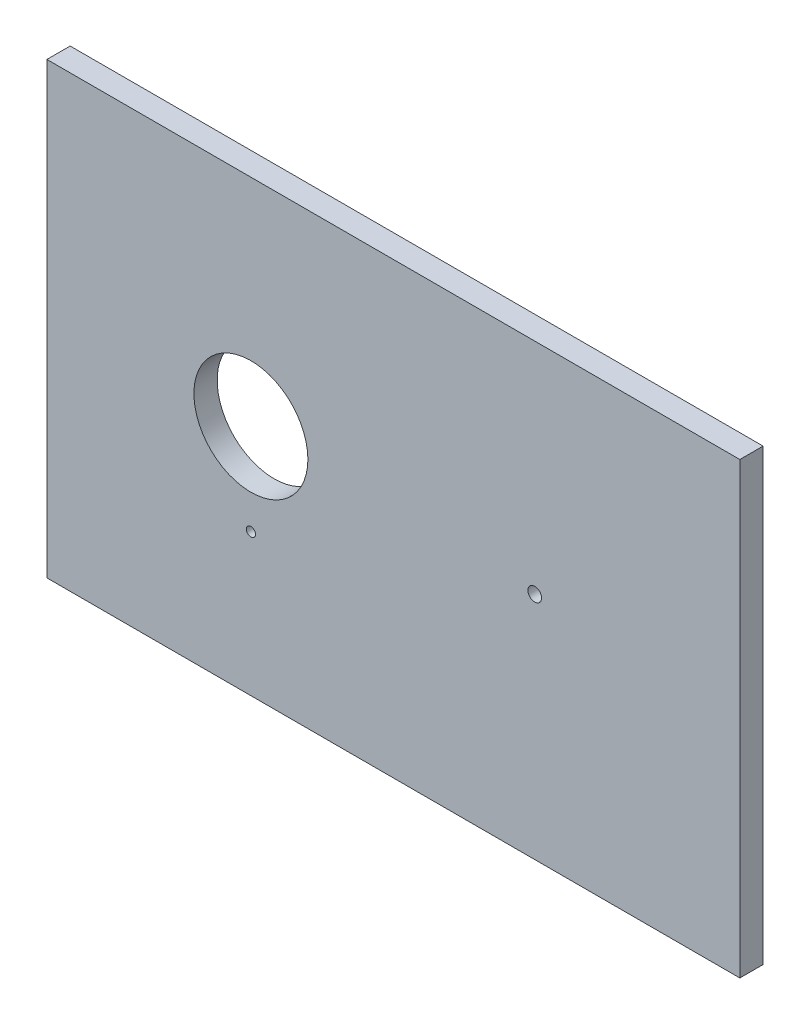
ISO-10303-21;
HEADER;
FILE_DESCRIPTION(('STEP AP214'),'2;1');
FILE_NAME('part.step','',(''),(''),'','','');
FILE_SCHEMA(('AUTOMOTIVE_DESIGN { 1 0 10303 214 1 1 1 1 }'));
ENDSEC;
DATA;
#1=APPLICATION_CONTEXT('core data for automotive mechanical design processes');
#2=APPLICATION_PROTOCOL_DEFINITION('international standard','automotive_design',2000,#1);
#3=PRODUCT_CONTEXT('',#1,'mechanical');
#4=PRODUCT('Part','Part','',(#3));
#5=PRODUCT_RELATED_PRODUCT_CATEGORY('part','',(#4));
#6=PRODUCT_DEFINITION_FORMATION('','',#4);
#7=PRODUCT_DEFINITION_CONTEXT('part definition',#1,'design');
#8=PRODUCT_DEFINITION('design','',#6,#7);
#9=PRODUCT_DEFINITION_SHAPE('','',#8);
#10=(LENGTH_UNIT() NAMED_UNIT(*) SI_UNIT(.MILLI.,.METRE.));
#11=(NAMED_UNIT(*) PLANE_ANGLE_UNIT() SI_UNIT($,.RADIAN.));
#12=(NAMED_UNIT(*) SI_UNIT($,.STERADIAN.) SOLID_ANGLE_UNIT());
#13=UNCERTAINTY_MEASURE_WITH_UNIT(LENGTH_MEASURE(1.E-05),#10,'distance_accuracy_value','');
#14=(GEOMETRIC_REPRESENTATION_CONTEXT(3) GLOBAL_UNCERTAINTY_ASSIGNED_CONTEXT((#13)) GLOBAL_UNIT_ASSIGNED_CONTEXT((#10,
#11,#12)) REPRESENTATION_CONTEXT('',''));
#15=CARTESIAN_POINT('',(0.,0.,0.));
#16=DIRECTION('',(0.,0.,1.));
#17=DIRECTION('',(1.,0.,0.));
#18=AXIS2_PLACEMENT_3D('',#15,#16,#17);
#19=CARTESIAN_POINT('',(152.,98.5,5.1));
#20=DIRECTION('',(-1.,0.,0.));
#21=DIRECTION('',(0.,-1.,0.));
#22=AXIS2_PLACEMENT_3D('',#19,#20,#21);
#23=PLANE('',#22);
#24=DIRECTION('',(0.,1.,0.));
#25=VECTOR('',#24,1.);
#26=CARTESIAN_POINT('',(152.,98.5,-5.1));
#27=LINE('',#26,#25);
#28=CARTESIAN_POINT('',(152.,-98.5,-5.1));
#29=VERTEX_POINT('',#28);
#30=CARTESIAN_POINT('',(152.,98.5,-5.1));
#31=VERTEX_POINT('',#30);
#32=EDGE_CURVE('E98',#29,#31,#27,.T.);
#33=ORIENTED_EDGE('',*,*,#32,.T.);
#34=DIRECTION('',(0.,0.,-1.));
#35=VECTOR('',#34,1.);
#36=CARTESIAN_POINT('',(152.,98.5,5.1));
#37=LINE('',#36,#35);
#38=CARTESIAN_POINT('',(152.,98.5,5.1));
#39=VERTEX_POINT('',#38);
#40=EDGE_CURVE('E11',#39,#31,#37,.T.);
#41=ORIENTED_EDGE('',*,*,#40,.F.);
#42=DIRECTION('',(0.,1.,0.));
#43=VECTOR('',#42,1.);
#44=CARTESIAN_POINT('',(152.,98.5,5.1));
#45=LINE('',#44,#43);
#46=CARTESIAN_POINT('',(152.,-98.5,5.1));
#47=VERTEX_POINT('',#46);
#48=EDGE_CURVE('E85',#47,#39,#45,.T.);
#49=ORIENTED_EDGE('',*,*,#48,.F.);
#50=DIRECTION('',(0.,0.,-1.));
#51=VECTOR('',#50,1.);
#52=CARTESIAN_POINT('',(152.,-98.5,5.1));
#53=LINE('',#52,#51);
#54=EDGE_CURVE('E94',#47,#29,#53,.T.);
#55=ORIENTED_EDGE('',*,*,#54,.T.);
#56=EDGE_LOOP('',(#33,#41,#49,#55));
#57=FACE_BOUND('',#56,.T.);
#58=ADVANCED_FACE('F32',(#57),#23,.F.);
#59=CARTESIAN_POINT('',(-152.,98.5,5.1));
#60=DIRECTION('',(0.,-1.,0.));
#61=DIRECTION('',(0.,0.,-1.));
#62=AXIS2_PLACEMENT_3D('',#59,#60,#61);
#63=PLANE('',#62);
#64=DIRECTION('',(-1.,0.,0.));
#65=VECTOR('',#64,1.);
#66=CARTESIAN_POINT('',(-152.,98.5,-5.1));
#67=LINE('',#66,#65);
#68=CARTESIAN_POINT('',(-152.,98.5,-5.1));
#69=VERTEX_POINT('',#68);
#70=EDGE_CURVE('E89',#31,#69,#67,.T.);
#71=ORIENTED_EDGE('',*,*,#70,.T.);
#72=DIRECTION('',(0.,0.,-1.));
#73=VECTOR('',#72,1.);
#74=CARTESIAN_POINT('',(-152.,98.5,5.1));
#75=LINE('',#74,#73);
#76=CARTESIAN_POINT('',(-152.,98.5,5.1));
#77=VERTEX_POINT('',#76);
#78=EDGE_CURVE('E41',#77,#69,#75,.T.);
#79=ORIENTED_EDGE('',*,*,#78,.F.);
#80=DIRECTION('',(-1.,0.,0.));
#81=VECTOR('',#80,1.);
#82=CARTESIAN_POINT('',(-152.,98.5,5.1));
#83=LINE('',#82,#81);
#84=EDGE_CURVE('E80',#39,#77,#83,.T.);
#85=ORIENTED_EDGE('',*,*,#84,.F.);
#86=ORIENTED_EDGE('',*,*,#40,.T.);
#87=EDGE_LOOP('',(#71,#79,#85,#86));
#88=FACE_BOUND('',#87,.T.);
#89=ADVANCED_FACE('F88',(#88),#63,.F.);
#90=CARTESIAN_POINT('',(-152.,98.5,5.1));
#91=DIRECTION('',(1.,0.,0.));
#92=DIRECTION('',(0.,0.,-1.));
#93=AXIS2_PLACEMENT_3D('',#90,#91,#92);
#94=PLANE('',#93);
#95=DIRECTION('',(0.,-1.,0.));
#96=VECTOR('',#95,1.);
#97=CARTESIAN_POINT('',(-152.,98.5,-5.1));
#98=LINE('',#97,#96);
#99=CARTESIAN_POINT('',(-152.,-98.5,-5.1));
#100=VERTEX_POINT('',#99);
#101=EDGE_CURVE('E67',#69,#100,#98,.T.);
#102=ORIENTED_EDGE('',*,*,#101,.T.);
#103=DIRECTION('',(0.,0.,-1.));
#104=VECTOR('',#103,1.);
#105=CARTESIAN_POINT('',(-152.,-98.5,5.1));
#106=LINE('',#105,#104);
#107=CARTESIAN_POINT('',(-152.,-98.5,5.1));
#108=VERTEX_POINT('',#107);
#109=EDGE_CURVE('E90',#108,#100,#106,.T.);
#110=ORIENTED_EDGE('',*,*,#109,.F.);
#111=DIRECTION('',(0.,-1.,0.));
#112=VECTOR('',#111,1.);
#113=CARTESIAN_POINT('',(-152.,98.5,5.1));
#114=LINE('',#113,#112);
#115=EDGE_CURVE('E83',#77,#108,#114,.T.);
#116=ORIENTED_EDGE('',*,*,#115,.F.);
#117=ORIENTED_EDGE('',*,*,#78,.T.);
#118=EDGE_LOOP('',(#102,#110,#116,#117));
#119=FACE_BOUND('',#118,.T.);
#120=ADVANCED_FACE('F92',(#119),#94,.F.);
#121=CARTESIAN_POINT('',(-152.,-98.5,5.1));
#122=DIRECTION('',(0.,1.,0.));
#123=DIRECTION('',(0.,0.,1.));
#124=AXIS2_PLACEMENT_3D('',#121,#122,#123);
#125=PLANE('',#124);
#126=DIRECTION('',(1.,0.,0.));
#127=VECTOR('',#126,1.);
#128=CARTESIAN_POINT('',(-152.,-98.5,-5.1));
#129=LINE('',#128,#127);
#130=EDGE_CURVE('E73',#100,#29,#129,.T.);
#131=ORIENTED_EDGE('',*,*,#130,.T.);
#132=ORIENTED_EDGE('',*,*,#54,.F.);
#133=DIRECTION('',(1.,0.,0.));
#134=VECTOR('',#133,1.);
#135=CARTESIAN_POINT('',(-152.,-98.5,5.1));
#136=LINE('',#135,#134);
#137=EDGE_CURVE('E50',#108,#47,#136,.T.);
#138=ORIENTED_EDGE('',*,*,#137,.F.);
#139=ORIENTED_EDGE('',*,*,#109,.T.);
#140=EDGE_LOOP('',(#131,#132,#138,#139));
#141=FACE_BOUND('',#140,.T.);
#142=ADVANCED_FACE('F156',(#141),#125,.F.);
#143=CARTESIAN_POINT('',(0.,0.,5.1));
#144=DIRECTION('',(0.,0.,1.));
#145=DIRECTION('',(1.,0.,0.));
#146=AXIS2_PLACEMENT_3D('',#143,#144,#145);
#147=PLANE('',#146);
#148=CARTESIAN_POINT('',(-62.5046863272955,-36.2005831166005,5.1));
#149=DIRECTION('',(0.,0.,1.));
#150=DIRECTION('',(1.,0.,0.));
#151=AXIS2_PLACEMENT_3D('',#148,#149,#150);
#152=CIRCLE('',#151,1.99999999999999);
#153=CARTESIAN_POINT('',(-60.5046863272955,-36.2005831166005,5.1));
#154=VERTEX_POINT('',#153);
#155=EDGE_CURVE('E109',#154,#154,#152,.T.);
#156=ORIENTED_EDGE('',*,*,#155,.F.);
#157=EDGE_LOOP('',(#156));
#158=FACE_BOUND('',#157,.T.);
#159=CARTESIAN_POINT('',(-62.5046863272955,3.7994168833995,5.1));
#160=DIRECTION('',(0.,0.,1.));
#161=DIRECTION('',(1.,0.,0.));
#162=AXIS2_PLACEMENT_3D('',#159,#160,#161);
#163=CIRCLE('',#162,25.);
#164=CARTESIAN_POINT('',(-37.5046863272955,3.7994168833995,5.1));
#165=VERTEX_POINT('',#164);
#166=EDGE_CURVE('E101',#165,#165,#163,.T.);
#167=ORIENTED_EDGE('',*,*,#166,.F.);
#168=EDGE_LOOP('',(#167));
#169=FACE_BOUND('',#168,.T.);
#170=CARTESIAN_POINT('',(62.0060459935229,2.34573843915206,5.1));
#171=DIRECTION('',(0.,0.,1.));
#172=DIRECTION('',(1.,0.,0.));
#173=AXIS2_PLACEMENT_3D('',#170,#171,#172);
#174=CIRCLE('',#173,2.99999999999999);
#175=CARTESIAN_POINT('',(65.0060459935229,2.34573843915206,5.1));
#176=VERTEX_POINT('',#175);
#177=EDGE_CURVE('E108',#176,#176,#174,.T.);
#178=ORIENTED_EDGE('',*,*,#177,.F.);
#179=EDGE_LOOP('',(#178));
#180=FACE_BOUND('',#179,.T.);
#181=ORIENTED_EDGE('',*,*,#48,.T.);
#182=ORIENTED_EDGE('',*,*,#84,.T.);
#183=ORIENTED_EDGE('',*,*,#115,.T.);
#184=ORIENTED_EDGE('',*,*,#137,.T.);
#185=EDGE_LOOP('',(#181,#182,#183,#184));
#186=FACE_BOUND('',#185,.T.);
#187=ADVANCED_FACE('F81',(#158,#169,#180,#186),#147,.T.);
#188=CARTESIAN_POINT('',(0.,0.,-5.1));
#189=DIRECTION('',(0.,0.,1.));
#190=DIRECTION('',(1.,0.,0.));
#191=AXIS2_PLACEMENT_3D('',#188,#189,#190);
#192=PLANE('',#191);
#193=CARTESIAN_POINT('',(-62.5046863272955,-36.2005831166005,-5.1));
#194=DIRECTION('',(0.,0.,1.));
#195=DIRECTION('',(1.,0.,0.));
#196=AXIS2_PLACEMENT_3D('',#193,#194,#195);
#197=CIRCLE('',#196,1.99999999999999);
#198=CARTESIAN_POINT('',(-60.5046863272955,-36.2005831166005,-5.1));
#199=VERTEX_POINT('',#198);
#200=EDGE_CURVE('E115',#199,#199,#197,.T.);
#201=ORIENTED_EDGE('',*,*,#200,.T.);
#202=EDGE_LOOP('',(#201));
#203=FACE_BOUND('',#202,.T.);
#204=CARTESIAN_POINT('',(-62.5046863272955,3.7994168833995,-5.1));
#205=DIRECTION('',(0.,0.,1.));
#206=DIRECTION('',(1.,0.,0.));
#207=AXIS2_PLACEMENT_3D('',#204,#205,#206);
#208=CIRCLE('',#207,25.);
#209=CARTESIAN_POINT('',(-37.5046863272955,3.7994168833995,-5.1));
#210=VERTEX_POINT('',#209);
#211=EDGE_CURVE('E35',#210,#210,#208,.T.);
#212=ORIENTED_EDGE('',*,*,#211,.T.);
#213=EDGE_LOOP('',(#212));
#214=FACE_BOUND('',#213,.T.);
#215=CARTESIAN_POINT('',(62.0060459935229,2.34573843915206,-5.1));
#216=DIRECTION('',(0.,0.,1.));
#217=DIRECTION('',(1.,0.,0.));
#218=AXIS2_PLACEMENT_3D('',#215,#216,#217);
#219=CIRCLE('',#218,2.99999999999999);
#220=CARTESIAN_POINT('',(65.0060459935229,2.34573843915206,-5.1));
#221=VERTEX_POINT('',#220);
#222=EDGE_CURVE('E106',#221,#221,#219,.T.);
#223=ORIENTED_EDGE('',*,*,#222,.T.);
#224=EDGE_LOOP('',(#223));
#225=FACE_BOUND('',#224,.T.);
#226=ORIENTED_EDGE('',*,*,#32,.F.);
#227=ORIENTED_EDGE('',*,*,#130,.F.);
#228=ORIENTED_EDGE('',*,*,#101,.F.);
#229=ORIENTED_EDGE('',*,*,#70,.F.);
#230=EDGE_LOOP('',(#226,#227,#228,#229));
#231=FACE_BOUND('',#230,.T.);
#232=ADVANCED_FACE('F128',(#203,#214,#225,#231),#192,.F.);
#233=CARTESIAN_POINT('',(62.0060459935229,2.34573843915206,-10.9000000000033));
#234=DIRECTION('',(0.,0.,1.));
#235=DIRECTION('',(1.,0.,0.));
#236=AXIS2_PLACEMENT_3D('',#233,#234,#235);
#237=CYLINDRICAL_SURFACE('',#236,2.99999999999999);
#238=ORIENTED_EDGE('',*,*,#177,.T.);
#239=EDGE_LOOP('',(#238));
#240=FACE_BOUND('',#239,.T.);
#241=ORIENTED_EDGE('',*,*,#222,.F.);
#242=EDGE_LOOP('',(#241));
#243=FACE_BOUND('',#242,.T.);
#244=ADVANCED_FACE('F133',(#240,#243),#237,.F.);
#245=CARTESIAN_POINT('',(-62.5046863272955,3.7994168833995,-10.9000000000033));
#246=DIRECTION('',(0.,0.,1.));
#247=DIRECTION('',(1.,0.,0.));
#248=AXIS2_PLACEMENT_3D('',#245,#246,#247);
#249=CYLINDRICAL_SURFACE('',#248,25.);
#250=ORIENTED_EDGE('',*,*,#166,.T.);
#251=EDGE_LOOP('',(#250));
#252=FACE_BOUND('',#251,.T.);
#253=ORIENTED_EDGE('',*,*,#211,.F.);
#254=EDGE_LOOP('',(#253));
#255=FACE_BOUND('',#254,.T.);
#256=ADVANCED_FACE('F130',(#252,#255),#249,.F.);
#257=CARTESIAN_POINT('',(-62.5046863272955,-36.2005831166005,-5.1));
#258=DIRECTION('',(0.,0.,1.));
#259=DIRECTION('',(1.,0.,0.));
#260=AXIS2_PLACEMENT_3D('',#257,#258,#259);
#261=CYLINDRICAL_SURFACE('',#260,1.99999999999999);
#262=ORIENTED_EDGE('',*,*,#155,.T.);
#263=EDGE_LOOP('',(#262));
#264=FACE_BOUND('',#263,.T.);
#265=ORIENTED_EDGE('',*,*,#200,.F.);
#266=EDGE_LOOP('',(#265));
#267=FACE_BOUND('',#266,.T.);
#268=ADVANCED_FACE('F132',(#264,#267),#261,.F.);
#269=CLOSED_SHELL('',(#58,#89,#120,#142,#187,#232,#244,#256,#268));
#270=MANIFOLD_SOLID_BREP('B2',#269);
#271=ADVANCED_BREP_SHAPE_REPRESENTATION('',(#18,#270),#14);
#272=SHAPE_DEFINITION_REPRESENTATION(#9,#271);
ENDSEC;
END-ISO-10303-21;
